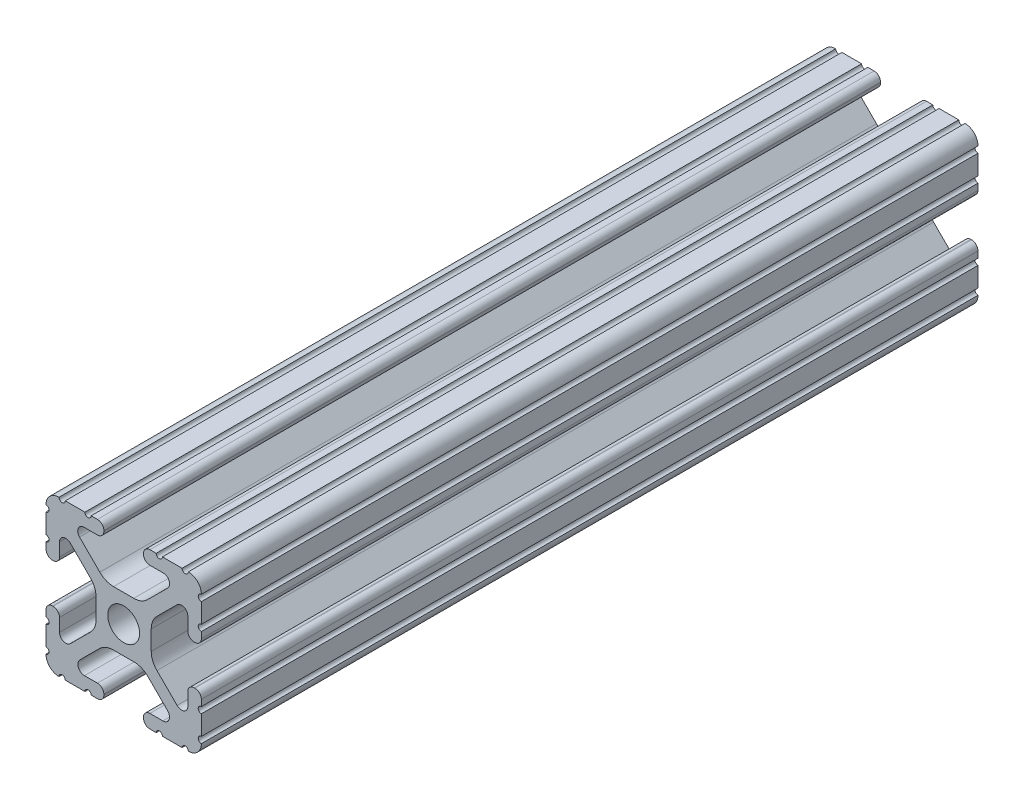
from build123d import *

# Parameters (mm, degrees)
SKETCH1_R      = 2.6035
EXTRUDE1_DEPTH = 127


with BuildPart() as part:
    # Sketch1 → Extrude1 (new body)
    with BuildSketch(Plane.XY):
        with BuildLine():
            Line((-7.207036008, 8.724370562), (-3.898272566, 5.423169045))
            ThreePointArc((-3.898272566, 5.423169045), (-2.869120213, 4.736787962), (-1.655778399, 4.4958))
            Line((-1.655778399, 4.4958), (1.655778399, 4.4958))
            ThreePointArc((1.655778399, 4.4958), (2.869120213, 4.736787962), (3.898272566, 5.423169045))
            Line((3.898272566, 5.423169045), (7.207036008, 8.724370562))
            ThreePointArc((7.207036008, 8.724370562), (7.432222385, 9.85140422), (6.476788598, 10.4902))
            Line((6.476788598, 10.4902), (4.287512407, 10.4902))
            ThreePointArc((4.287512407, 10.4902), (3.54574862, 10.79744862), (3.2385, 11.539212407))
            Line((3.2385, 11.539212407), (3.2385, 11.650987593))
            ThreePointArc((3.2385, 11.650987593), (3.54574862, 12.39275138), (4.287512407, 12.7))
            Line((4.287512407, 12.7), (5.317126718, 12.7))
            ThreePointArc((5.317126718, 12.7), (5.825126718, 12.192), (6.333126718, 12.7))
            Line((6.333126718, 12.7), (9.550443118, 12.7))
            ThreePointArc((9.550443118, 12.7), (10.058366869, 12.192000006), (10.566443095, 12.699847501))
            ThreePointArc((10.566443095, 12.699847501), (12.082537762, 12.08250727), (12.699846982, 10.566399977))
            ThreePointArc((12.699846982, 10.566399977), (12.192000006, 10.058323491), (12.7, 9.5504))
            Line((12.7, 9.5504), (12.7, 6.3330836))
            ThreePointArc((12.7, 6.3330836), (12.192, 5.8250836), (12.7, 5.3170836))
            Line((12.7, 5.3170836), (12.7, 4.287469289))
            ThreePointArc((12.7, 4.287469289), (12.39275138, 3.545705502), (11.650987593, 3.238456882))
            Line((11.650987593, 3.238456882), (11.539212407, 3.238456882))
            ThreePointArc((11.539212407, 3.238456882), (10.79744862, 3.545705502), (10.4902, 4.287469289))
            Line((10.4902, 4.287469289), (10.4902, 6.402089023))
            ThreePointArc((10.4902, 6.402089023), (9.856505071, 7.351067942), (8.737131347, 7.129408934))
            Line((8.737131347, 7.129408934), (5.441005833, 3.840816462))
            ThreePointArc((5.441005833, 3.840816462), (4.750877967, 2.809883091), (4.5085, 1.593185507))
            Line((4.5085, 1.593185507), (4.5085, -1.593185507))
            ThreePointArc((4.5085, -1.593185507), (4.750877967, -2.809883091), (5.441005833, -3.840816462))
            Line((5.441005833, -3.840816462), (8.737131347, -7.129408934))
            ThreePointArc((8.737131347, -7.129408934), (9.856505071, -7.351067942), (10.4902, -6.402089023))
            Line((10.4902, -6.402089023), (10.4902, -4.287469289))
            ThreePointArc((10.4902, -4.287469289), (10.79744862, -3.545705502), (11.539212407, -3.238456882))
            Line((11.539212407, -3.238456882), (11.650987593, -3.238456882))
            ThreePointArc((11.650987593, -3.238456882), (12.39275138, -3.545705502), (12.7, -4.287469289))
            Line((12.7, -4.287469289), (12.7, -5.3170836))
            ThreePointArc((12.7, -5.3170836), (12.192, -5.8250836), (12.7, -6.3330836))
            Line((12.7, -6.3330836), (12.7, -9.5504))
            ThreePointArc((12.7, -9.5504), (12.192000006, -10.058323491), (12.699846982, -10.566399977))
            ThreePointArc((12.699846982, -10.566399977), (12.082537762, -12.08250727), (10.566443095, -12.699847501))
            ThreePointArc((10.566443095, -12.699847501), (10.058366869, -12.192000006), (9.550443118, -12.7))
            Line((9.550443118, -12.7), (6.333126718, -12.7))
            ThreePointArc((6.333126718, -12.7), (5.825126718, -12.192), (5.317126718, -12.7))
            Line((5.317126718, -12.7), (4.287512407, -12.7))
            ThreePointArc((4.287512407, -12.7), (3.54574862, -12.39275138), (3.2385, -11.650987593))
            Line((3.2385, -11.650987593), (3.2385, -11.539212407))
            ThreePointArc((3.2385, -11.539212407), (3.54574862, -10.79744862), (4.287512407, -10.4902))
            Line((4.287512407, -10.4902), (6.416408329, -10.4902))
            ThreePointArc((6.416408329, -10.4902), (7.41473083, -9.822813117), (7.179650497, -8.645192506))
            Line((7.179650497, -8.645192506), (3.952270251, -5.423690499))
            ThreePointArc((3.952270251, -5.423690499), (2.922936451, -4.736929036), (1.709253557, -4.4958))
            Line((1.709253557, -4.4958), (-1.709253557, -4.4958))
            ThreePointArc((-1.709253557, -4.4958), (-2.922936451, -4.736929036), (-3.952270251, -5.423690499))
            Line((-3.952270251, -5.423690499), (-7.179650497, -8.645192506))
            ThreePointArc((-7.179650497, -8.645192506), (-7.41473083, -9.822813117), (-6.416408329, -10.4902))
            Line((-6.416408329, -10.4902), (-4.287512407, -10.4902))
            ThreePointArc((-4.287512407, -10.4902), (-3.54574862, -10.79744862), (-3.2385, -11.539212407))
            Line((-3.2385, -11.539212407), (-3.2385, -11.650987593))
            ThreePointArc((-3.2385, -11.650987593), (-3.54574862, -12.39275138), (-4.287512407, -12.7))
            Line((-4.287512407, -12.7), (-5.317126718, -12.7))
            ThreePointArc((-5.317126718, -12.7), (-5.825126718, -12.192), (-6.333126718, -12.7))
            Line((-6.333126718, -12.7), (-9.550443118, -12.7))
            ThreePointArc((-9.550443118, -12.7), (-10.058366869, -12.192000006), (-10.566443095, -12.699847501))
            ThreePointArc((-10.566443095, -12.699847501), (-12.082537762, -12.08250727), (-12.699846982, -10.566399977))
            ThreePointArc((-12.699846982, -10.566399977), (-12.192000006, -10.058323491), (-12.7, -9.5504))
            Line((-12.7, -9.5504), (-12.7, -6.3330836))
            ThreePointArc((-12.7, -6.3330836), (-12.192, -5.8250836), (-12.7, -5.3170836))
            Line((-12.7, -5.3170836), (-12.7, -4.287469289))
            ThreePointArc((-12.7, -4.287469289), (-12.39275138, -3.545705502), (-11.650987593, -3.238456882))
            Line((-11.650987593, -3.238456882), (-11.539212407, -3.238456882))
            ThreePointArc((-11.539212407, -3.238456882), (-10.79744862, -3.545705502), (-10.4902, -4.287469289))
            Line((-10.4902, -4.287469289), (-10.4902, -6.402089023))
            ThreePointArc((-10.4902, -6.402089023), (-9.856505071, -7.351067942), (-8.737131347, -7.129408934))
            Line((-8.737131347, -7.129408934), (-5.441005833, -3.840816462))
            ThreePointArc((-5.441005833, -3.840816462), (-4.750877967, -2.809883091), (-4.5085, -1.593185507))
            Line((-4.5085, -1.593185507), (-4.5085, 1.593185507))
            ThreePointArc((-4.5085, 1.593185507), (-4.750877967, 2.809883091), (-5.441005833, 3.840816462))
            Line((-5.441005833, 3.840816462), (-8.737131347, 7.129408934))
            ThreePointArc((-8.737131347, 7.129408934), (-9.856505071, 7.351067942), (-10.4902, 6.402089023))
            Line((-10.4902, 6.402089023), (-10.4902, 4.287469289))
            ThreePointArc((-10.4902, 4.287469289), (-10.79744862, 3.545705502), (-11.539212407, 3.238456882))
            Line((-11.539212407, 3.238456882), (-11.650987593, 3.238456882))
            ThreePointArc((-11.650987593, 3.238456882), (-12.39275138, 3.545705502), (-12.7, 4.287469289))
            Line((-12.7, 4.287469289), (-12.7, 5.3170836))
            ThreePointArc((-12.7, 5.3170836), (-12.192, 5.8250836), (-12.7, 6.3330836))
            Line((-12.7, 6.3330836), (-12.7, 9.5504))
            ThreePointArc((-12.7, 9.5504), (-12.192000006, 10.058323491), (-12.699846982, 10.566399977))
            ThreePointArc((-12.699846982, 10.566399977), (-12.082537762, 12.08250727), (-10.566443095, 12.699847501))
            ThreePointArc((-10.566443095, 12.699847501), (-10.058366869, 12.192000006), (-9.550443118, 12.7))
            Line((-9.550443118, 12.7), (-6.333126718, 12.7))
            ThreePointArc((-6.333126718, 12.7), (-5.825126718, 12.192), (-5.317126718, 12.7))
            Line((-5.317126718, 12.7), (-4.287512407, 12.7))
            ThreePointArc((-4.287512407, 12.7), (-3.54574862, 12.39275138), (-3.2385, 11.650987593))
            Line((-3.2385, 11.650987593), (-3.2385, 11.539212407))
            ThreePointArc((-3.2385, 11.539212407), (-3.54574862, 10.79744862), (-4.287512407, 10.4902))
            Line((-4.287512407, 10.4902), (-6.476788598, 10.4902))
            ThreePointArc((-6.476788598, 10.4902), (-7.432222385, 9.85140422), (-7.207036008, 8.724370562))
        make_face()
        Circle(SKETCH1_R, mode=Mode.SUBTRACT)
    extrude(amount=-EXTRUDE1_DEPTH)


solid = part.part
